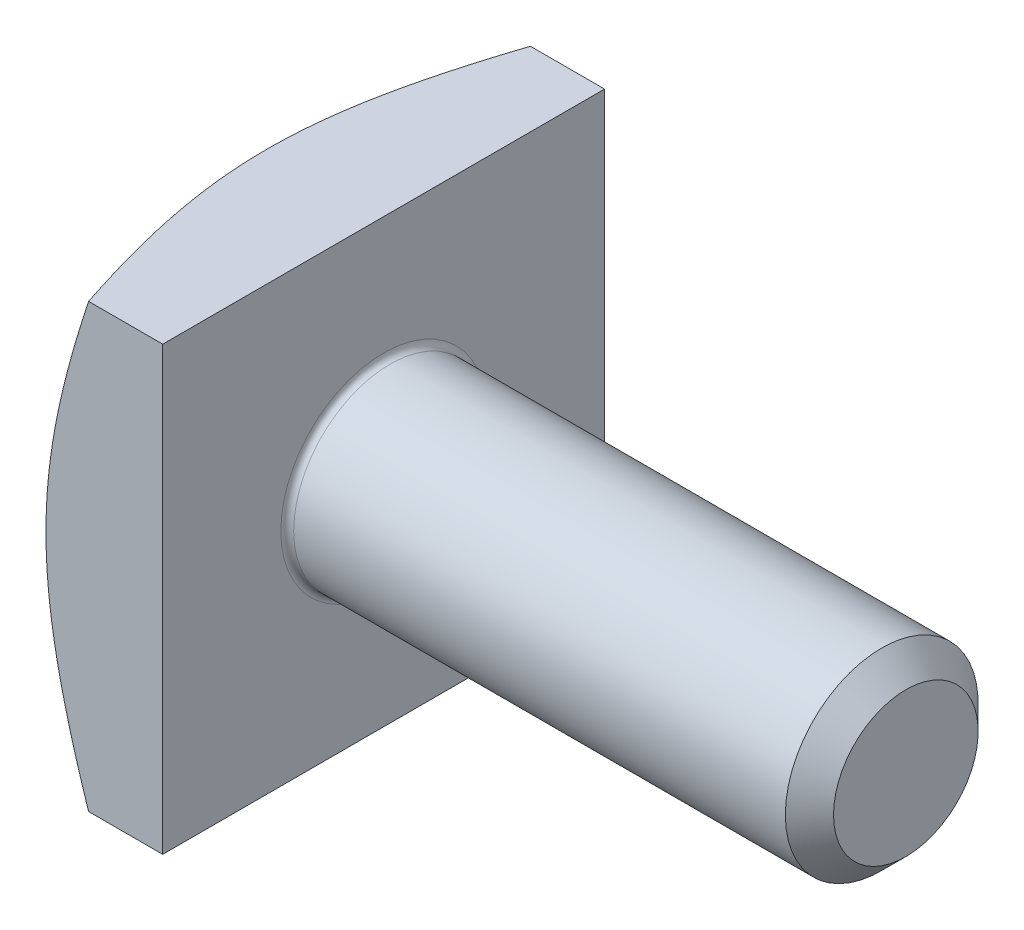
from build123d import *

# Parameters (mm, degrees)
BASEHEADSKE_W  = 55
BASEHEADSKE_H  = 55
BASEHEAD_DEPTH = 15
BODYSKE_W      = 80
BODYSKE_H      = 12
FILLET_2_R     = 0.8


with BuildPart() as part:
    # BaseHeadSke → BaseHead (new body)
    with BuildSketch(Plane(origin=(0, 0, 0), x_dir=(0, 0, -1), z_dir=(1, 0, 0))):
        Rectangle(BASEHEADSKE_W, BASEHEADSKE_H)
    extrude(amount=BASEHEAD_DEPTH)

    # BodySke → BaseBody (revolve)
    with BuildSketch(Plane.XY, mode=Mode.PRIVATE) as basebody_sk:
        with Locations((40, 6)):
            Rectangle(BODYSKE_W, BODYSKE_H)
    revolve(basebody_sk.sketch.rotate(Axis((0, 0, 0), (1, 0, 0)), 90), axis=Axis((0, 0, 0), (1, 0, 0)))

    # ChamferEndSke → ChamferEnd (revolve, cut)
    with BuildSketch(Plane(origin=(0, 0, 0), x_dir=(1, 0, 0), z_dir=(0, 1, 0))):
        Polygon((77, -12), (80, -9), (80, -12), align=None)
    revolve(axis=Axis((0, 0, 0), (1, 0, 0)), mode=Mode.SUBTRACT)

    # HeadChamferSke → HeadChamfer (revolve, cut)
    with BuildSketch(Plane.XY, mode=Mode.PRIVATE) as headchamfer_sk:
        Polygon((15, 58.667603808), (0, 58.667603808), (0, 26.5), align=None)
    revolve(headchamfer_sk.sketch.rotate(Axis((0, 0, 0), (1, 0, 0)), 314.999999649), axis=Axis((0, 0, 0), (1, 0, 0)), mode=Mode.SUBTRACT)

    # Fillet 2
    fillet_2_edges = [part.edges().sort_by_distance(p)[0] for p in [
        (15, 0, -12),
    ]]
    fillet(fillet_2_edges, radius=FILLET_2_R)


solid = part.part
